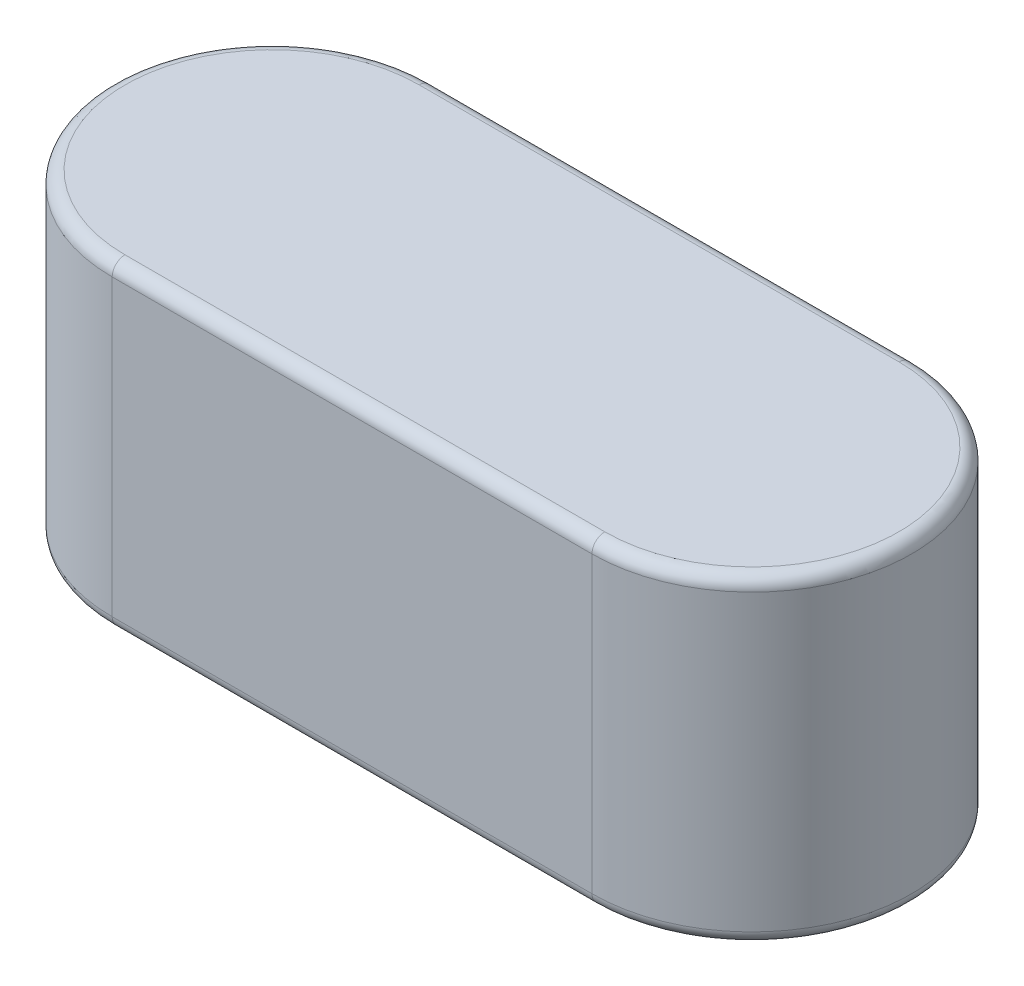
from build123d import *

# Parameters (mm, degrees)
EXTRUDE1_DEPTH = 4
FILLET1_R      = 0.16


with BuildPart() as part:
    # Sketch1 → Extrude1 (new body)
    with BuildSketch(Plane(origin=(0, 0, 0), x_dir=(1, 0, 0), z_dir=(0, 1, 0))):
        with BuildLine():
            Line((-6, 2), (0, 2))
            ThreePointArc((0, 2), (2, 0), (0, -2))
            Line((0, -2), (-6, -2))
            ThreePointArc((-6, -2), (-8, 0), (-6, 2))
        make_face()
    extrude(amount=EXTRUDE1_DEPTH)

    # Fillet1
    fillet1_edges = [part.edges().sort_by_distance(p)[0] for p in [
        (2, 4, 0),
        (-3, 4, -2),
        (-8, 4, 0),
        (-3, 0, -2),
        (2, 0, 0),
        (-3, 0, 2),
        (-8, 0, 0),
        (-3, 4, 2),
    ]]
    fillet(fillet1_edges, radius=FILLET1_R)


solid = part.part
